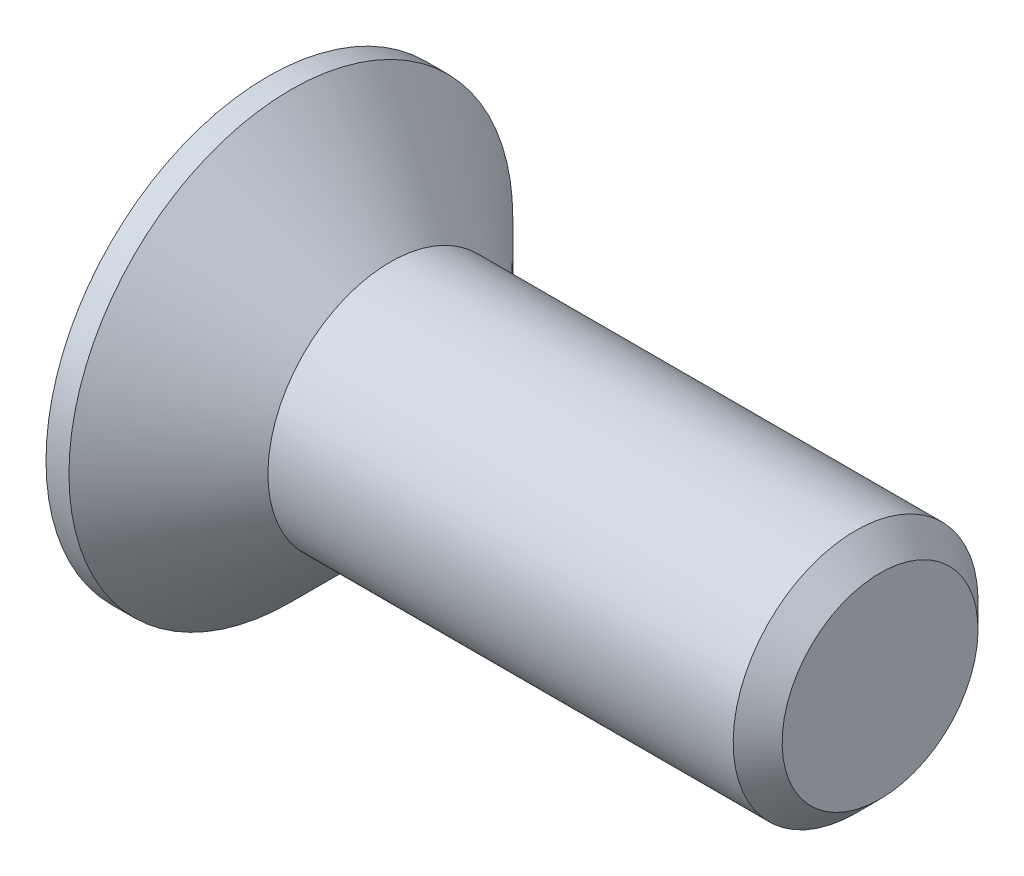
ISO-10303-21;
HEADER;
FILE_DESCRIPTION(('STEP AP214'),'2;1');
FILE_NAME('part.step','',(''),(''),'','','');
FILE_SCHEMA(('AUTOMOTIVE_DESIGN { 1 0 10303 214 1 1 1 1 }'));
ENDSEC;
DATA;
#1=APPLICATION_CONTEXT('core data for automotive mechanical design processes');
#2=APPLICATION_PROTOCOL_DEFINITION('international standard','automotive_design',2000,#1);
#3=PRODUCT_CONTEXT('',#1,'mechanical');
#4=PRODUCT('Part','Part','',(#3));
#5=PRODUCT_RELATED_PRODUCT_CATEGORY('part','',(#4));
#6=PRODUCT_DEFINITION_FORMATION('','',#4);
#7=PRODUCT_DEFINITION_CONTEXT('part definition',#1,'design');
#8=PRODUCT_DEFINITION('design','',#6,#7);
#9=PRODUCT_DEFINITION_SHAPE('','',#8);
#10=(LENGTH_UNIT() NAMED_UNIT(*) SI_UNIT(.MILLI.,.METRE.));
#11=(NAMED_UNIT(*) PLANE_ANGLE_UNIT() SI_UNIT($,.RADIAN.));
#12=(NAMED_UNIT(*) SI_UNIT($,.STERADIAN.) SOLID_ANGLE_UNIT());
#13=UNCERTAINTY_MEASURE_WITH_UNIT(LENGTH_MEASURE(1.E-05),#10,'distance_accuracy_value','');
#14=(GEOMETRIC_REPRESENTATION_CONTEXT(3) GLOBAL_UNCERTAINTY_ASSIGNED_CONTEXT((#13)) GLOBAL_UNIT_ASSIGNED_CONTEXT((#10,
#11,#12)) REPRESENTATION_CONTEXT('',''));
#15=CARTESIAN_POINT('',(0.,0.,0.));
#16=DIRECTION('',(0.,0.,1.));
#17=DIRECTION('',(1.,0.,0.));
#18=AXIS2_PLACEMENT_3D('',#15,#16,#17);
#19=CARTESIAN_POINT('',(0.,0.,0.));
#20=DIRECTION('',(-1.,0.,0.));
#21=DIRECTION('',(0.,-1.,0.));
#22=AXIS2_PLACEMENT_3D('',#19,#20,#21);
#23=CONICAL_SURFACE('',#22,4.,0.78539816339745);
#24=CARTESIAN_POINT('',(-3.24999999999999,0.,0.));
#25=DIRECTION('',(-1.,0.,0.));
#26=DIRECTION('',(0.,-1.,0.));
#27=AXIS2_PLACEMENT_3D('',#24,#25,#26);
#28=CIRCLE('',#27,7.25);
#29=CARTESIAN_POINT('',(-3.24999999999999,-7.25,0.));
#30=VERTEX_POINT('',#29);
#31=EDGE_CURVE('E189',#30,#30,#28,.T.);
#32=ORIENTED_EDGE('',*,*,#31,.F.);
#33=EDGE_LOOP('',(#32));
#34=FACE_BOUND('',#33,.T.);
#35=CARTESIAN_POINT('',(0.,0.,0.));
#36=DIRECTION('',(-1.,0.,0.));
#37=DIRECTION('',(0.,-1.,0.));
#38=AXIS2_PLACEMENT_3D('',#35,#36,#37);
#39=CIRCLE('',#38,4.);
#40=CARTESIAN_POINT('',(0.,-4.,0.));
#41=VERTEX_POINT('',#40);
#42=EDGE_CURVE('E212',#41,#41,#39,.T.);
#43=ORIENTED_EDGE('',*,*,#42,.T.);
#44=EDGE_LOOP('',(#43));
#45=FACE_BOUND('',#44,.T.);
#46=ADVANCED_FACE('F33',(#34,#45),#23,.T.);
#47=CARTESIAN_POINT('',(-4.,0.,0.));
#48=DIRECTION('',(-1.,0.,0.));
#49=DIRECTION('',(0.,-1.,0.));
#50=AXIS2_PLACEMENT_3D('',#47,#48,#49);
#51=CYLINDRICAL_SURFACE('',#50,4.);
#52=CARTESIAN_POINT('',(15.2,0.,0.));
#53=DIRECTION('',(-1.,0.,0.));
#54=DIRECTION('',(0.,-1.,0.));
#55=AXIS2_PLACEMENT_3D('',#52,#53,#54);
#56=CIRCLE('',#55,4.);
#57=CARTESIAN_POINT('',(15.2,-4.,0.));
#58=VERTEX_POINT('',#57);
#59=EDGE_CURVE('E41',#58,#58,#56,.T.);
#60=ORIENTED_EDGE('',*,*,#59,.T.);
#61=EDGE_LOOP('',(#60));
#62=FACE_BOUND('',#61,.T.);
#63=ORIENTED_EDGE('',*,*,#42,.F.);
#64=EDGE_LOOP('',(#63));
#65=FACE_BOUND('',#64,.T.);
#66=ADVANCED_FACE('F217',(#62,#65),#51,.T.);
#67=CARTESIAN_POINT('',(16.,0.,0.));
#68=DIRECTION('',(-1.,0.,0.));
#69=DIRECTION('',(0.,-1.,0.));
#70=AXIS2_PLACEMENT_3D('',#67,#68,#69);
#71=PLANE('',#70);
#72=CARTESIAN_POINT('',(16.,0.,0.));
#73=DIRECTION('',(-1.,0.,0.));
#74=DIRECTION('',(0.,-1.,0.));
#75=AXIS2_PLACEMENT_3D('',#72,#73,#74);
#76=CIRCLE('',#75,3.20000000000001);
#77=CARTESIAN_POINT('',(16.,-3.20000000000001,0.));
#78=VERTEX_POINT('',#77);
#79=EDGE_CURVE('E11',#78,#78,#76,.F.);
#80=ORIENTED_EDGE('',*,*,#79,.T.);
#81=EDGE_LOOP('',(#80));
#82=FACE_BOUND('',#81,.T.);
#83=ADVANCED_FACE('F239',(#82),#71,.F.);
#84=CARTESIAN_POINT('',(-4.,7.25,0.));
#85=DIRECTION('',(1.,0.,0.));
#86=DIRECTION('',(0.,1.,0.));
#87=AXIS2_PLACEMENT_3D('',#84,#85,#86);
#88=PLANE('',#87);
#89=DIRECTION('',(0.,0.,-1.));
#90=VECTOR('',#89,1.);
#91=CARTESIAN_POINT('',(-4.,1.09,-4.35));
#92=LINE('',#91,#90);
#93=CARTESIAN_POINT('',(-4.,1.09,-1.09));
#94=VERTEX_POINT('',#93);
#95=CARTESIAN_POINT('',(-4.,1.09,-4.35));
#96=VERTEX_POINT('',#95);
#97=EDGE_CURVE('E158',#94,#96,#92,.T.);
#98=ORIENTED_EDGE('',*,*,#97,.F.);
#99=DIRECTION('',(0.,-1.,0.));
#100=VECTOR('',#99,1.);
#101=CARTESIAN_POINT('',(-4.,1.09,-1.09));
#102=LINE('',#101,#100);
#103=CARTESIAN_POINT('',(-4.,4.35,-1.09));
#104=VERTEX_POINT('',#103);
#105=EDGE_CURVE('E48',#104,#94,#102,.T.);
#106=ORIENTED_EDGE('',*,*,#105,.F.);
#107=DIRECTION('',(0.,0.,-1.));
#108=VECTOR('',#107,1.);
#109=CARTESIAN_POINT('',(-4.,4.35,-1.09));
#110=LINE('',#109,#108);
#111=CARTESIAN_POINT('',(-4.,4.35,1.09));
#112=VERTEX_POINT('',#111);
#113=EDGE_CURVE('E185',#112,#104,#110,.T.);
#114=ORIENTED_EDGE('',*,*,#113,.F.);
#115=DIRECTION('',(0.,1.,0.));
#116=VECTOR('',#115,1.);
#117=CARTESIAN_POINT('',(-4.,4.35,1.09));
#118=LINE('',#117,#116);
#119=CARTESIAN_POINT('',(-4.,1.09,1.09));
#120=VERTEX_POINT('',#119);
#121=EDGE_CURVE('E183',#120,#112,#118,.T.);
#122=ORIENTED_EDGE('',*,*,#121,.F.);
#123=DIRECTION('',(0.,0.,-1.));
#124=VECTOR('',#123,1.);
#125=CARTESIAN_POINT('',(-4.,1.09,1.09));
#126=LINE('',#125,#124);
#127=CARTESIAN_POINT('',(-4.,1.09,4.35));
#128=VERTEX_POINT('',#127);
#129=EDGE_CURVE('E132',#128,#120,#126,.T.);
#130=ORIENTED_EDGE('',*,*,#129,.F.);
#131=DIRECTION('',(0.,1.,0.));
#132=VECTOR('',#131,1.);
#133=CARTESIAN_POINT('',(-4.,1.09,4.35));
#134=LINE('',#133,#132);
#135=CARTESIAN_POINT('',(-4.,-1.09,4.35));
#136=VERTEX_POINT('',#135);
#137=EDGE_CURVE('E179',#136,#128,#134,.T.);
#138=ORIENTED_EDGE('',*,*,#137,.F.);
#139=DIRECTION('',(0.,0.,1.));
#140=VECTOR('',#139,1.);
#141=CARTESIAN_POINT('',(-4.,-1.09,4.35));
#142=LINE('',#141,#140);
#143=CARTESIAN_POINT('',(-4.,-1.09,1.09));
#144=VERTEX_POINT('',#143);
#145=EDGE_CURVE('E176',#144,#136,#142,.T.);
#146=ORIENTED_EDGE('',*,*,#145,.F.);
#147=DIRECTION('',(0.,1.,0.));
#148=VECTOR('',#147,1.);
#149=CARTESIAN_POINT('',(-4.,-1.09,1.09));
#150=LINE('',#149,#148);
#151=CARTESIAN_POINT('',(-4.,-4.35,1.09));
#152=VERTEX_POINT('',#151);
#153=EDGE_CURVE('E173',#152,#144,#150,.T.);
#154=ORIENTED_EDGE('',*,*,#153,.F.);
#155=DIRECTION('',(0.,0.,1.));
#156=VECTOR('',#155,1.);
#157=CARTESIAN_POINT('',(-4.,-4.35,1.09));
#158=LINE('',#157,#156);
#159=CARTESIAN_POINT('',(-4.,-4.35,-1.09));
#160=VERTEX_POINT('',#159);
#161=EDGE_CURVE('E170',#160,#152,#158,.T.);
#162=ORIENTED_EDGE('',*,*,#161,.F.);
#163=DIRECTION('',(0.,-1.,0.));
#164=VECTOR('',#163,1.);
#165=CARTESIAN_POINT('',(-4.,-4.35,-1.09));
#166=LINE('',#165,#164);
#167=CARTESIAN_POINT('',(-4.,-1.09,-1.09));
#168=VERTEX_POINT('',#167);
#169=EDGE_CURVE('E167',#168,#160,#166,.T.);
#170=ORIENTED_EDGE('',*,*,#169,.F.);
#171=DIRECTION('',(0.,0.,1.));
#172=VECTOR('',#171,1.);
#173=CARTESIAN_POINT('',(-4.,-1.09,-1.09));
#174=LINE('',#173,#172);
#175=CARTESIAN_POINT('',(-4.,-1.09,-4.35));
#176=VERTEX_POINT('',#175);
#177=EDGE_CURVE('E164',#176,#168,#174,.T.);
#178=ORIENTED_EDGE('',*,*,#177,.F.);
#179=DIRECTION('',(0.,-1.,0.));
#180=VECTOR('',#179,1.);
#181=CARTESIAN_POINT('',(-4.,-1.09,-4.35));
#182=LINE('',#181,#180);
#183=EDGE_CURVE('E161',#96,#176,#182,.T.);
#184=ORIENTED_EDGE('',*,*,#183,.F.);
#185=EDGE_LOOP('',(#98,#106,#114,#122,#130,#138,#146,#154,#162,#170,#178,#184));
#186=FACE_BOUND('',#185,.T.);
#187=CARTESIAN_POINT('',(-4.,0.,0.));
#188=DIRECTION('',(-1.,0.,0.));
#189=DIRECTION('',(0.,-1.,0.));
#190=AXIS2_PLACEMENT_3D('',#187,#188,#189);
#191=CIRCLE('',#190,7.25);
#192=CARTESIAN_POINT('',(-4.,-7.25,0.));
#193=VERTEX_POINT('',#192);
#194=EDGE_CURVE('E209',#193,#193,#191,.T.);
#195=ORIENTED_EDGE('',*,*,#194,.T.);
#196=EDGE_LOOP('',(#195));
#197=FACE_BOUND('',#196,.T.);
#198=ADVANCED_FACE('F230',(#186,#197),#88,.F.);
#199=CARTESIAN_POINT('',(-4.,0.,0.));
#200=DIRECTION('',(-1.,0.,0.));
#201=DIRECTION('',(0.,-1.,0.));
#202=AXIS2_PLACEMENT_3D('',#199,#200,#201);
#203=CYLINDRICAL_SURFACE('',#202,7.25);
#204=ORIENTED_EDGE('',*,*,#194,.F.);
#205=EDGE_LOOP('',(#204));
#206=FACE_BOUND('',#205,.T.);
#207=ORIENTED_EDGE('',*,*,#31,.T.);
#208=EDGE_LOOP('',(#207));
#209=FACE_BOUND('',#208,.T.);
#210=ADVANCED_FACE('F222',(#206,#209),#203,.T.);
#211=CARTESIAN_POINT('',(15.2,0.,0.));
#212=DIRECTION('',(-1.,0.,0.));
#213=DIRECTION('',(0.,-1.,0.));
#214=AXIS2_PLACEMENT_3D('',#211,#212,#213);
#215=CONICAL_SURFACE('',#214,4.,0.785398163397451);
#216=ORIENTED_EDGE('',*,*,#79,.F.);
#217=EDGE_LOOP('',(#216));
#218=FACE_BOUND('',#217,.T.);
#219=ORIENTED_EDGE('',*,*,#59,.F.);
#220=EDGE_LOOP('',(#219));
#221=FACE_BOUND('',#220,.T.);
#222=ADVANCED_FACE('F35',(#218,#221),#215,.T.);
#223=CARTESIAN_POINT('',(-0.55,1.09,-1.09));
#224=DIRECTION('',(0.,0.,-1.));
#225=DIRECTION('',(-1.,0.,0.));
#226=AXIS2_PLACEMENT_3D('',#223,#224,#225);
#227=PLANE('',#226);
#228=ORIENTED_EDGE('',*,*,#105,.T.);
#229=DIRECTION('',(-1.,0.,0.));
#230=VECTOR('',#229,1.);
#231=CARTESIAN_POINT('',(-0.55,1.09,-1.09));
#232=LINE('',#231,#230);
#233=CARTESIAN_POINT('',(-0.55,1.09,-1.09));
#234=VERTEX_POINT('',#233);
#235=EDGE_CURVE('E96',#234,#94,#232,.T.);
#236=ORIENTED_EDGE('',*,*,#235,.F.);
#237=DIRECTION('',(0.,-1.,0.));
#238=VECTOR('',#237,1.);
#239=CARTESIAN_POINT('',(-0.55,1.09,-1.09));
#240=LINE('',#239,#238);
#241=CARTESIAN_POINT('',(-0.55,4.35,-1.09));
#242=VERTEX_POINT('',#241);
#243=EDGE_CURVE('E187',#242,#234,#240,.T.);
#244=ORIENTED_EDGE('',*,*,#243,.F.);
#245=DIRECTION('',(-1.,0.,0.));
#246=VECTOR('',#245,1.);
#247=CARTESIAN_POINT('',(-0.55,4.35,-1.09));
#248=LINE('',#247,#246);
#249=EDGE_CURVE('E56',#242,#104,#248,.T.);
#250=ORIENTED_EDGE('',*,*,#249,.T.);
#251=EDGE_LOOP('',(#228,#236,#244,#250));
#252=FACE_BOUND('',#251,.T.);
#253=ADVANCED_FACE('F221',(#252),#227,.F.);
#254=CARTESIAN_POINT('',(-0.55,4.35,-1.09));
#255=DIRECTION('',(0.,1.,0.));
#256=DIRECTION('',(-1.,0.,0.));
#257=AXIS2_PLACEMENT_3D('',#254,#255,#256);
#258=PLANE('',#257);
#259=ORIENTED_EDGE('',*,*,#113,.T.);
#260=ORIENTED_EDGE('',*,*,#249,.F.);
#261=DIRECTION('',(0.,0.,-1.));
#262=VECTOR('',#261,1.);
#263=CARTESIAN_POINT('',(-0.55,4.35,-1.09));
#264=LINE('',#263,#262);
#265=CARTESIAN_POINT('',(-0.55,4.35,1.09));
#266=VERTEX_POINT('',#265);
#267=EDGE_CURVE('E144',#266,#242,#264,.T.);
#268=ORIENTED_EDGE('',*,*,#267,.F.);
#269=DIRECTION('',(-1.,0.,0.));
#270=VECTOR('',#269,1.);
#271=CARTESIAN_POINT('',(-0.55,4.35,1.09));
#272=LINE('',#271,#270);
#273=EDGE_CURVE('E136',#266,#112,#272,.T.);
#274=ORIENTED_EDGE('',*,*,#273,.T.);
#275=EDGE_LOOP('',(#259,#260,#268,#274));
#276=FACE_BOUND('',#275,.T.);
#277=ADVANCED_FACE('F228',(#276),#258,.F.);
#278=CARTESIAN_POINT('',(-0.55,4.35,1.09));
#279=DIRECTION('',(0.,0.,1.));
#280=DIRECTION('',(1.,0.,0.));
#281=AXIS2_PLACEMENT_3D('',#278,#279,#280);
#282=PLANE('',#281);
#283=ORIENTED_EDGE('',*,*,#121,.T.);
#284=ORIENTED_EDGE('',*,*,#273,.F.);
#285=DIRECTION('',(0.,1.,0.));
#286=VECTOR('',#285,1.);
#287=CARTESIAN_POINT('',(-0.55,4.35,1.09));
#288=LINE('',#287,#286);
#289=CARTESIAN_POINT('',(-0.55,1.09,1.09));
#290=VERTEX_POINT('',#289);
#291=EDGE_CURVE('E140',#290,#266,#288,.T.);
#292=ORIENTED_EDGE('',*,*,#291,.F.);
#293=DIRECTION('',(-1.,0.,0.));
#294=VECTOR('',#293,1.);
#295=CARTESIAN_POINT('',(-0.55,1.09,1.09));
#296=LINE('',#295,#294);
#297=EDGE_CURVE('E125',#290,#120,#296,.T.);
#298=ORIENTED_EDGE('',*,*,#297,.T.);
#299=EDGE_LOOP('',(#283,#284,#292,#298));
#300=FACE_BOUND('',#299,.T.);
#301=ADVANCED_FACE('F141',(#300),#282,.F.);
#302=CARTESIAN_POINT('',(-0.55,1.09,1.09));
#303=DIRECTION('',(0.,1.,0.));
#304=DIRECTION('',(-1.,0.,0.));
#305=AXIS2_PLACEMENT_3D('',#302,#303,#304);
#306=PLANE('',#305);
#307=ORIENTED_EDGE('',*,*,#129,.T.);
#308=ORIENTED_EDGE('',*,*,#297,.F.);
#309=DIRECTION('',(0.,0.,-1.));
#310=VECTOR('',#309,1.);
#311=CARTESIAN_POINT('',(-0.55,1.09,1.09));
#312=LINE('',#311,#310);
#313=CARTESIAN_POINT('',(-0.55,1.09,4.35));
#314=VERTEX_POINT('',#313);
#315=EDGE_CURVE('E129',#314,#290,#312,.T.);
#316=ORIENTED_EDGE('',*,*,#315,.F.);
#317=DIRECTION('',(-1.,0.,0.));
#318=VECTOR('',#317,1.);
#319=CARTESIAN_POINT('',(-0.55,1.09,4.35));
#320=LINE('',#319,#318);
#321=EDGE_CURVE('E137',#314,#128,#320,.T.);
#322=ORIENTED_EDGE('',*,*,#321,.T.);
#323=EDGE_LOOP('',(#307,#308,#316,#322));
#324=FACE_BOUND('',#323,.T.);
#325=ADVANCED_FACE('F127',(#324),#306,.F.);
#326=CARTESIAN_POINT('',(-0.55,1.09,4.35));
#327=DIRECTION('',(0.,0.,1.));
#328=DIRECTION('',(1.,0.,0.));
#329=AXIS2_PLACEMENT_3D('',#326,#327,#328);
#330=PLANE('',#329);
#331=ORIENTED_EDGE('',*,*,#137,.T.);
#332=ORIENTED_EDGE('',*,*,#321,.F.);
#333=DIRECTION('',(0.,1.,0.));
#334=VECTOR('',#333,1.);
#335=CARTESIAN_POINT('',(-0.55,1.09,4.35));
#336=LINE('',#335,#334);
#337=CARTESIAN_POINT('',(-0.55,-1.09,4.35));
#338=VERTEX_POINT('',#337);
#339=EDGE_CURVE('E150',#338,#314,#336,.T.);
#340=ORIENTED_EDGE('',*,*,#339,.F.);
#341=DIRECTION('',(-1.,0.,0.));
#342=VECTOR('',#341,1.);
#343=CARTESIAN_POINT('',(-0.55,-1.09,4.35));
#344=LINE('',#343,#342);
#345=EDGE_CURVE('E192',#338,#136,#344,.T.);
#346=ORIENTED_EDGE('',*,*,#345,.T.);
#347=EDGE_LOOP('',(#331,#332,#340,#346));
#348=FACE_BOUND('',#347,.T.);
#349=ADVANCED_FACE('F277',(#348),#330,.F.);
#350=CARTESIAN_POINT('',(-0.55,-1.09,4.35));
#351=DIRECTION('',(0.,-1.,0.));
#352=DIRECTION('',(1.,0.,0.));
#353=AXIS2_PLACEMENT_3D('',#350,#351,#352);
#354=PLANE('',#353);
#355=ORIENTED_EDGE('',*,*,#145,.T.);
#356=ORIENTED_EDGE('',*,*,#345,.F.);
#357=DIRECTION('',(0.,0.,1.));
#358=VECTOR('',#357,1.);
#359=CARTESIAN_POINT('',(-0.55,-1.09,4.35));
#360=LINE('',#359,#358);
#361=CARTESIAN_POINT('',(-0.55,-1.09,1.09));
#362=VERTEX_POINT('',#361);
#363=EDGE_CURVE('E152',#362,#338,#360,.T.);
#364=ORIENTED_EDGE('',*,*,#363,.F.);
#365=DIRECTION('',(-1.,0.,0.));
#366=VECTOR('',#365,1.);
#367=CARTESIAN_POINT('',(-0.55,-1.09,1.09));
#368=LINE('',#367,#366);
#369=EDGE_CURVE('E194',#362,#144,#368,.T.);
#370=ORIENTED_EDGE('',*,*,#369,.T.);
#371=EDGE_LOOP('',(#355,#356,#364,#370));
#372=FACE_BOUND('',#371,.T.);
#373=ADVANCED_FACE('F273',(#372),#354,.F.);
#374=CARTESIAN_POINT('',(-0.55,-1.09,1.09));
#375=DIRECTION('',(0.,0.,1.));
#376=DIRECTION('',(1.,0.,0.));
#377=AXIS2_PLACEMENT_3D('',#374,#375,#376);
#378=PLANE('',#377);
#379=ORIENTED_EDGE('',*,*,#153,.T.);
#380=ORIENTED_EDGE('',*,*,#369,.F.);
#381=DIRECTION('',(0.,1.,0.));
#382=VECTOR('',#381,1.);
#383=CARTESIAN_POINT('',(-0.55,-1.09,1.09));
#384=LINE('',#383,#382);
#385=CARTESIAN_POINT('',(-0.55,-4.35,1.09));
#386=VERTEX_POINT('',#385);
#387=EDGE_CURVE('E422',#386,#362,#384,.T.);
#388=ORIENTED_EDGE('',*,*,#387,.F.);
#389=DIRECTION('',(-1.,0.,0.));
#390=VECTOR('',#389,1.);
#391=CARTESIAN_POINT('',(-0.55,-4.35,1.09));
#392=LINE('',#391,#390);
#393=EDGE_CURVE('E196',#386,#152,#392,.T.);
#394=ORIENTED_EDGE('',*,*,#393,.T.);
#395=EDGE_LOOP('',(#379,#380,#388,#394));
#396=FACE_BOUND('',#395,.T.);
#397=ADVANCED_FACE('F269',(#396),#378,.F.);
#398=CARTESIAN_POINT('',(-0.55,-4.35,1.09));
#399=DIRECTION('',(0.,-1.,0.));
#400=DIRECTION('',(1.,0.,0.));
#401=AXIS2_PLACEMENT_3D('',#398,#399,#400);
#402=PLANE('',#401);
#403=ORIENTED_EDGE('',*,*,#161,.T.);
#404=ORIENTED_EDGE('',*,*,#393,.F.);
#405=DIRECTION('',(0.,0.,1.));
#406=VECTOR('',#405,1.);
#407=CARTESIAN_POINT('',(-0.55,-4.35,1.09));
#408=LINE('',#407,#406);
#409=CARTESIAN_POINT('',(-0.55,-4.35,-1.09));
#410=VERTEX_POINT('',#409);
#411=EDGE_CURVE('E419',#410,#386,#408,.T.);
#412=ORIENTED_EDGE('',*,*,#411,.F.);
#413=DIRECTION('',(-1.,0.,0.));
#414=VECTOR('',#413,1.);
#415=CARTESIAN_POINT('',(-0.55,-4.35,-1.09));
#416=LINE('',#415,#414);
#417=EDGE_CURVE('E198',#410,#160,#416,.T.);
#418=ORIENTED_EDGE('',*,*,#417,.T.);
#419=EDGE_LOOP('',(#403,#404,#412,#418));
#420=FACE_BOUND('',#419,.T.);
#421=ADVANCED_FACE('F265',(#420),#402,.F.);
#422=CARTESIAN_POINT('',(-0.55,-4.35,-1.09));
#423=DIRECTION('',(0.,0.,-1.));
#424=DIRECTION('',(-1.,0.,0.));
#425=AXIS2_PLACEMENT_3D('',#422,#423,#424);
#426=PLANE('',#425);
#427=ORIENTED_EDGE('',*,*,#169,.T.);
#428=ORIENTED_EDGE('',*,*,#417,.F.);
#429=DIRECTION('',(0.,-1.,0.));
#430=VECTOR('',#429,1.);
#431=CARTESIAN_POINT('',(-0.55,-4.35,-1.09));
#432=LINE('',#431,#430);
#433=CARTESIAN_POINT('',(-0.55,-1.09,-1.09));
#434=VERTEX_POINT('',#433);
#435=EDGE_CURVE('E416',#434,#410,#432,.T.);
#436=ORIENTED_EDGE('',*,*,#435,.F.);
#437=DIRECTION('',(-1.,0.,0.));
#438=VECTOR('',#437,1.);
#439=CARTESIAN_POINT('',(-0.55,-1.09,-1.09));
#440=LINE('',#439,#438);
#441=EDGE_CURVE('E200',#434,#168,#440,.T.);
#442=ORIENTED_EDGE('',*,*,#441,.T.);
#443=EDGE_LOOP('',(#427,#428,#436,#442));
#444=FACE_BOUND('',#443,.T.);
#445=ADVANCED_FACE('F261',(#444),#426,.F.);
#446=CARTESIAN_POINT('',(-0.55,-1.09,-1.09));
#447=DIRECTION('',(0.,-1.,0.));
#448=DIRECTION('',(1.,0.,0.));
#449=AXIS2_PLACEMENT_3D('',#446,#447,#448);
#450=PLANE('',#449);
#451=ORIENTED_EDGE('',*,*,#177,.T.);
#452=ORIENTED_EDGE('',*,*,#441,.F.);
#453=DIRECTION('',(0.,0.,1.));
#454=VECTOR('',#453,1.);
#455=CARTESIAN_POINT('',(-0.55,-1.09,-1.09));
#456=LINE('',#455,#454);
#457=CARTESIAN_POINT('',(-0.55,-1.09,-4.35));
#458=VERTEX_POINT('',#457);
#459=EDGE_CURVE('E413',#458,#434,#456,.T.);
#460=ORIENTED_EDGE('',*,*,#459,.F.);
#461=DIRECTION('',(-1.,0.,0.));
#462=VECTOR('',#461,1.);
#463=CARTESIAN_POINT('',(-0.55,-1.09,-4.35));
#464=LINE('',#463,#462);
#465=EDGE_CURVE('E202',#458,#176,#464,.T.);
#466=ORIENTED_EDGE('',*,*,#465,.T.);
#467=EDGE_LOOP('',(#451,#452,#460,#466));
#468=FACE_BOUND('',#467,.T.);
#469=ADVANCED_FACE('F257',(#468),#450,.F.);
#470=CARTESIAN_POINT('',(-0.55,-1.09,-4.35));
#471=DIRECTION('',(0.,0.,-1.));
#472=DIRECTION('',(-1.,0.,0.));
#473=AXIS2_PLACEMENT_3D('',#470,#471,#472);
#474=PLANE('',#473);
#475=ORIENTED_EDGE('',*,*,#183,.T.);
#476=ORIENTED_EDGE('',*,*,#465,.F.);
#477=DIRECTION('',(0.,-1.,0.));
#478=VECTOR('',#477,1.);
#479=CARTESIAN_POINT('',(-0.55,-1.09,-4.35));
#480=LINE('',#479,#478);
#481=CARTESIAN_POINT('',(-0.55,1.09,-4.35));
#482=VERTEX_POINT('',#481);
#483=EDGE_CURVE('E408',#482,#458,#480,.T.);
#484=ORIENTED_EDGE('',*,*,#483,.F.);
#485=DIRECTION('',(-1.,0.,0.));
#486=VECTOR('',#485,1.);
#487=CARTESIAN_POINT('',(-0.55,1.09,-4.35));
#488=LINE('',#487,#486);
#489=EDGE_CURVE('E204',#482,#96,#488,.T.);
#490=ORIENTED_EDGE('',*,*,#489,.T.);
#491=EDGE_LOOP('',(#475,#476,#484,#490));
#492=FACE_BOUND('',#491,.T.);
#493=ADVANCED_FACE('F253',(#492),#474,.F.);
#494=CARTESIAN_POINT('',(-0.55,1.09,-4.35));
#495=DIRECTION('',(0.,1.,0.));
#496=DIRECTION('',(-1.,0.,0.));
#497=AXIS2_PLACEMENT_3D('',#494,#495,#496);
#498=PLANE('',#497);
#499=ORIENTED_EDGE('',*,*,#97,.T.);
#500=ORIENTED_EDGE('',*,*,#489,.F.);
#501=DIRECTION('',(0.,0.,-1.));
#502=VECTOR('',#501,1.);
#503=CARTESIAN_POINT('',(-0.55,1.09,-4.35));
#504=LINE('',#503,#502);
#505=EDGE_CURVE('E406',#234,#482,#504,.T.);
#506=ORIENTED_EDGE('',*,*,#505,.F.);
#507=ORIENTED_EDGE('',*,*,#235,.T.);
#508=EDGE_LOOP('',(#499,#500,#506,#507));
#509=FACE_BOUND('',#508,.T.);
#510=ADVANCED_FACE('F250',(#509),#498,.F.);
#511=CARTESIAN_POINT('',(-0.55,0.,0.));
#512=DIRECTION('',(1.,0.,0.));
#513=DIRECTION('',(0.,0.,-1.));
#514=AXIS2_PLACEMENT_3D('',#511,#512,#513);
#515=PLANE('',#514);
#516=ORIENTED_EDGE('',*,*,#243,.T.);
#517=ORIENTED_EDGE('',*,*,#505,.T.);
#518=ORIENTED_EDGE('',*,*,#483,.T.);
#519=ORIENTED_EDGE('',*,*,#459,.T.);
#520=ORIENTED_EDGE('',*,*,#435,.T.);
#521=ORIENTED_EDGE('',*,*,#411,.T.);
#522=ORIENTED_EDGE('',*,*,#387,.T.);
#523=ORIENTED_EDGE('',*,*,#363,.T.);
#524=ORIENTED_EDGE('',*,*,#339,.T.);
#525=ORIENTED_EDGE('',*,*,#315,.T.);
#526=ORIENTED_EDGE('',*,*,#291,.T.);
#527=ORIENTED_EDGE('',*,*,#267,.T.);
#528=EDGE_LOOP('',(#516,#517,#518,#519,#520,#521,#522,#523,#524,#525,#526,#527));
#529=FACE_BOUND('',#528,.T.);
#530=ADVANCED_FACE('F147',(#529),#515,.F.);
#531=CLOSED_SHELL('',(#46,#66,#83,#198,#210,#222,#253,#277,#301,#325,#349,#373,#397,#421,#445,
#469,#493,#510,#530));
#532=MANIFOLD_SOLID_BREP('B2',#531);
#533=ADVANCED_BREP_SHAPE_REPRESENTATION('',(#18,#532),#14);
#534=SHAPE_DEFINITION_REPRESENTATION(#9,#533);
ENDSEC;
END-ISO-10303-21;
